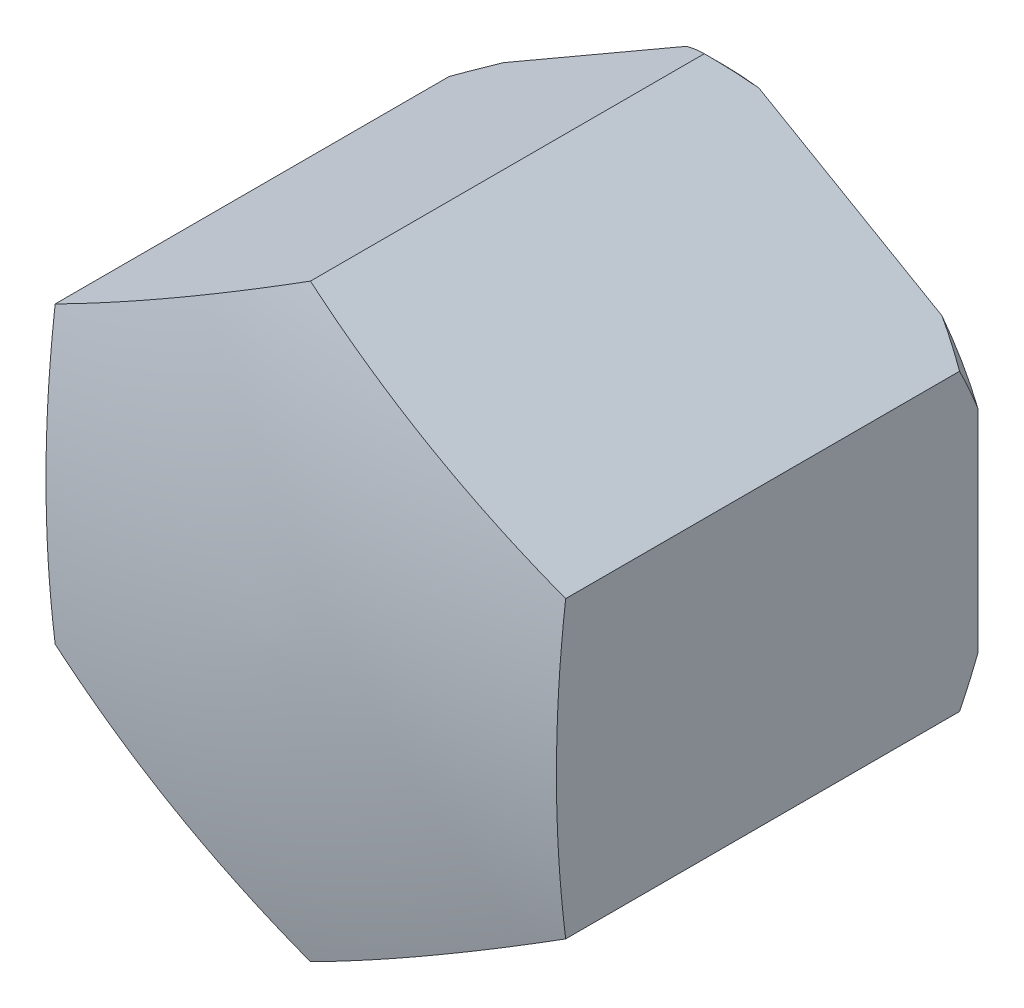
ISO-10303-21;
HEADER;
FILE_DESCRIPTION(('STEP AP214'),'2;1');
FILE_NAME('part.step','',(''),(''),'','','');
FILE_SCHEMA(('AUTOMOTIVE_DESIGN { 1 0 10303 214 1 1 1 1 }'));
ENDSEC;
DATA;
#1=APPLICATION_CONTEXT('core data for automotive mechanical design processes');
#2=APPLICATION_PROTOCOL_DEFINITION('international standard','automotive_design',2000,#1);
#3=PRODUCT_CONTEXT('',#1,'mechanical');
#4=PRODUCT('Part','Part','',(#3));
#5=PRODUCT_RELATED_PRODUCT_CATEGORY('part','',(#4));
#6=PRODUCT_DEFINITION_FORMATION('','',#4);
#7=PRODUCT_DEFINITION_CONTEXT('part definition',#1,'design');
#8=PRODUCT_DEFINITION('design','',#6,#7);
#9=PRODUCT_DEFINITION_SHAPE('','',#8);
#10=(LENGTH_UNIT() NAMED_UNIT(*) SI_UNIT(.MILLI.,.METRE.));
#11=(NAMED_UNIT(*) PLANE_ANGLE_UNIT() SI_UNIT($,.RADIAN.));
#12=(NAMED_UNIT(*) SI_UNIT($,.STERADIAN.) SOLID_ANGLE_UNIT());
#13=UNCERTAINTY_MEASURE_WITH_UNIT(LENGTH_MEASURE(1.E-05),#10,'distance_accuracy_value','');
#14=(GEOMETRIC_REPRESENTATION_CONTEXT(3) GLOBAL_UNCERTAINTY_ASSIGNED_CONTEXT((#13)) GLOBAL_UNIT_ASSIGNED_CONTEXT((#10,
#11,#12)) REPRESENTATION_CONTEXT('',''));
#15=CARTESIAN_POINT('',(0.,0.,0.));
#16=DIRECTION('',(0.,0.,1.));
#17=DIRECTION('',(1.,0.,0.));
#18=AXIS2_PLACEMENT_3D('',#15,#16,#17);
#19=CARTESIAN_POINT('',(0.,0.,0.));
#20=DIRECTION('',(0.,0.,1.));
#21=DIRECTION('',(0.,-1.,0.));
#22=AXIS2_PLACEMENT_3D('',#19,#20,#21);
#23=CONICAL_SURFACE('',#22,9.2,0.785398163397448);
#24=CARTESIAN_POINT('',(-7.29790748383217,5.60150572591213,-0.000200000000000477));
#25=CARTESIAN_POINT('',(-7.40034153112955,5.5423654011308,0.0450508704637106));
#26=CARTESIAN_POINT('',(-7.50220788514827,5.48355283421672,0.0919939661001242));
#27=CARTESIAN_POINT('',(-7.70476505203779,5.36660639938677,0.188958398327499));
#28=CARTESIAN_POINT('',(-7.80545653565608,5.30847214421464,0.238977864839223));
#29=CARTESIAN_POINT('',(-8.00574073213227,5.19283800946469,0.341840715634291));
#30=CARTESIAN_POINT('',(-8.1053335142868,5.13533808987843,0.394683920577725));
#31=CARTESIAN_POINT('',(-8.30352176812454,5.02091404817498,0.502984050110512));
#32=CARTESIAN_POINT('',(-8.40211660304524,4.96399029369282,0.558442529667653));
#33=CARTESIAN_POINT('',(-8.5002,4.90736181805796,0.615070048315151));
#34=B_SPLINE_CURVE_WITH_KNOTS('',3,(#24,#25,#26,#27,#28,#29,#30,#31,#32,#33),.UNSPECIFIED.,.F.,
.F.,(4,2,2,2,4),(0.,0.379899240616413,0.759569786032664,1.13921624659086,1.51909135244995),.UNSPECIFIED.);
#35=CARTESIAN_POINT('',(-7.29836021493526,5.60124434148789,0.));
#36=VERTEX_POINT('',#35);
#37=CARTESIAN_POINT('',(-8.5,4.9074772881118,0.614954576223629));
#38=VERTEX_POINT('',#37);
#39=EDGE_CURVE('E130',#36,#38,#34,.T.);
#40=ORIENTED_EDGE('',*,*,#39,.F.);
#41=CARTESIAN_POINT('',(0.,0.,0.));
#42=DIRECTION('',(0.,0.,-1.));
#43=DIRECTION('',(0.,1.,0.));
#44=AXIS2_PLACEMENT_3D('',#41,#42,#43);
#45=CIRCLE('',#44,9.2);
#46=CARTESIAN_POINT('',(-8.5,3.51994318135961,0.));
#47=VERTEX_POINT('',#46);
#48=EDGE_CURVE('E126',#47,#36,#45,.T.);
#49=ORIENTED_EDGE('',*,*,#48,.F.);
#50=CARTESIAN_POINT('',(-8.5,12.4457835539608,5.8714142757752));
#51=CARTESIAN_POINT('',(-8.5,12.2891803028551,5.74209565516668));
#52=CARTESIAN_POINT('',(-8.5,12.1321984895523,5.61323567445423));
#53=CARTESIAN_POINT('',(-8.5,11.8174015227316,5.35653348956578));
#54=CARTESIAN_POINT('',(-8.5,11.6595863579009,5.22869129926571));
#55=CARTESIAN_POINT('',(-8.5,11.1847073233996,4.84678663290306));
#56=CARTESIAN_POINT('',(-8.5,10.8662846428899,4.59440792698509));
#57=CARTESIAN_POINT('',(-8.5,10.2215636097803,4.09244014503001));
#58=CARTESIAN_POINT('',(-8.5,9.89521710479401,3.84291277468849));
#59=CARTESIAN_POINT('',(-8.5,9.23720301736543,3.35102204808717));
#60=CARTESIAN_POINT('',(-8.5,8.90553596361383,3.10865798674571));
#61=CARTESIAN_POINT('',(-8.5,8.20300679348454,2.60983458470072));
#62=CARTESIAN_POINT('',(-8.5,7.83147860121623,2.35430822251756));
#63=CARTESIAN_POINT('',(-8.5,7.07854417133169,1.85782964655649));
#64=CARTESIAN_POINT('',(-8.5,6.69713462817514,1.61688240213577));
#65=CARTESIAN_POINT('',(-8.5,5.9240959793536,1.15610654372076));
#66=CARTESIAN_POINT('',(-8.5,5.53252322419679,0.936184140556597));
#67=CARTESIAN_POINT('',(-8.5,4.73517422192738,0.523967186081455));
#68=CARTESIAN_POINT('',(-8.5,4.32941107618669,0.331647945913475));
#69=CARTESIAN_POINT('',(-8.5,3.77043546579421,0.0977888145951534));
#70=CARTESIAN_POINT('',(-8.5,3.62423019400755,0.0393998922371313));
#71=CARTESIAN_POINT('',(-8.5,3.32981396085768,-0.0720721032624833));
#72=CARTESIAN_POINT('',(-8.5,3.18160301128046,-0.125155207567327));
#73=CARTESIAN_POINT('',(-8.5,2.73391822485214,-0.275575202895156));
#74=CARTESIAN_POINT('',(-8.5,2.43138559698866,-0.364085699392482));
#75=CARTESIAN_POINT('',(-8.5,1.82627230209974,-0.510857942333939));
#76=CARTESIAN_POINT('',(-8.5,1.52384972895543,-0.569762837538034));
#77=CARTESIAN_POINT('',(-8.5,0.914521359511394,-0.656255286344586));
#78=CARTESIAN_POINT('',(-8.5,0.607616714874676,-0.683850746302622));
#79=CARTESIAN_POINT('',(-8.5,0.00960417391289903,-0.704956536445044));
#80=CARTESIAN_POINT('',(-8.5,-0.28144036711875,-0.700264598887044));
#81=CARTESIAN_POINT('',(-8.5,-0.861531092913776,-0.661355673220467));
#82=CARTESIAN_POINT('',(-8.5,-1.1505771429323,-0.627136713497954));
#83=CARTESIAN_POINT('',(-8.5,-1.72963784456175,-0.530601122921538));
#84=CARTESIAN_POINT('',(-8.5,-2.01956183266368,-0.467750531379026));
#85=CARTESIAN_POINT('',(-8.5,-2.59290217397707,-0.317629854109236));
#86=CARTESIAN_POINT('',(-8.5,-2.87631858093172,-0.230359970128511));
#87=CARTESIAN_POINT('',(-8.5,-3.44063093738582,-0.0339340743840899));
#88=CARTESIAN_POINT('',(-8.5,-3.72140761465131,0.075560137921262));
#89=CARTESIAN_POINT('',(-8.5,-4.2757903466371,0.31154116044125));
#90=CARTESIAN_POINT('',(-8.5,-4.54939321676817,0.438035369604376));
#91=CARTESIAN_POINT('',(-8.5,-5.09067942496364,0.705019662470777));
#92=CARTESIAN_POINT('',(-8.5,-5.35834183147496,0.845551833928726));
#93=CARTESIAN_POINT('',(-8.5,-5.88755334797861,1.13753327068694));
#94=CARTESIAN_POINT('',(-8.5,-6.14910336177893,1.2889809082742));
#95=CARTESIAN_POINT('',(-8.5,-6.65407957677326,1.59296889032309));
#96=CARTESIAN_POINT('',(-8.5,-6.89776250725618,1.74508502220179));
#97=CARTESIAN_POINT('',(-8.5,-7.38094108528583,2.05584685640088));
#98=CARTESIAN_POINT('',(-8.5,-7.62043642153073,2.21449304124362));
#99=CARTESIAN_POINT('',(-8.5,-8.09388147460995,2.5358803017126));
#100=CARTESIAN_POINT('',(-8.5,-8.32786010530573,2.69857893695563));
#101=CARTESIAN_POINT('',(-8.5,-8.7925997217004,3.02837993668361));
#102=CARTESIAN_POINT('',(-8.5,-9.02336157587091,3.19548107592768));
#103=CARTESIAN_POINT('',(-8.5,-9.25277218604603,3.36438590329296));
#104=B_SPLINE_CURVE_WITH_KNOTS('',3,(#50,#51,#52,#53,#54,#55,#56,#57,#58,#59,#60,#61,#62,#63,
#64,#65,#66,#67,#68,#69,#70,#71,#72,#73,#74,#75,#76,#77,#78,#79,#80,#81,#82,#83,#84,#85,#86,#87,
#88,#89,#90,#91,#92,#93,#94,#95,#96,#97,#98,#99,#100,#101,#102,#103),.UNSPECIFIED.,.F.,.F.,(4,2,
2,2,2,2,2,2,2,2,2,2,2,2,2,2,2,2,2,2,2,2,2,2,2,2,4),(0.,0.60928566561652,1.21857962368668,
2.43745855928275,3.66981545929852,4.90205065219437,6.25455110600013,7.60750999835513,
8.95412045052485,10.2995188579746,10.7717304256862,11.2439392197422,12.1883345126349,
13.1112160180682,14.0338644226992,14.9055731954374,15.7773401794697,16.6660762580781,
17.5548049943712,18.4582369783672,19.3620634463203,20.2686860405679,21.1751737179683,
22.0368444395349,22.8985789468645,23.7534810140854,24.6081476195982),.UNSPECIFIED.);
#105=EDGE_CURVE('E155',#38,#47,#104,.T.);
#106=ORIENTED_EDGE('',*,*,#105,.F.);
#107=EDGE_LOOP('',(#40,#49,#106));
#108=FACE_BOUND('',#107,.T.);
#109=ADVANCED_FACE('F14',(#108),#23,.T.);
#110=CARTESIAN_POINT('',(-8.5,-3.51994318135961,0.));
#111=VERTEX_POINT('',#110);
#112=CARTESIAN_POINT('',(-8.5,-4.9074772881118,0.614954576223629));
#113=VERTEX_POINT('',#112);
#114=EDGE_CURVE('E151',#111,#113,#104,.T.);
#115=ORIENTED_EDGE('',*,*,#114,.F.);
#116=CARTESIAN_POINT('',(-7.29836021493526,-5.60124434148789,0.));
#117=VERTEX_POINT('',#116);
#118=EDGE_CURVE('E129',#117,#111,#45,.T.);
#119=ORIENTED_EDGE('',*,*,#118,.F.);
#120=CARTESIAN_POINT('',(-8.5002,-4.90736181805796,0.615070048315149));
#121=CARTESIAN_POINT('',(-8.40211660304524,-4.96399029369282,0.558442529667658));
#122=CARTESIAN_POINT('',(-8.30352176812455,-5.02091404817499,0.502984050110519));
#123=CARTESIAN_POINT('',(-8.1053335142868,-5.13533808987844,0.394683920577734));
#124=CARTESIAN_POINT('',(-8.00574073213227,-5.1928380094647,0.341840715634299));
#125=CARTESIAN_POINT('',(-7.80545653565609,-5.30847214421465,0.238977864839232));
#126=CARTESIAN_POINT('',(-7.70476505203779,-5.36660639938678,0.188958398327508));
#127=CARTESIAN_POINT('',(-7.50220788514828,-5.48355283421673,0.0919939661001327));
#128=CARTESIAN_POINT('',(-7.40034153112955,-5.54236540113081,0.0450508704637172));
#129=CARTESIAN_POINT('',(-7.29790748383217,-5.60150572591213,-0.00019999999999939));
#130=B_SPLINE_CURVE_WITH_KNOTS('',3,(#120,#121,#122,#123,#124,#125,#126,#127,#128,#129),
.UNSPECIFIED.,.F.,.F.,(4,2,2,2,4),(0.,0.379875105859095,0.759521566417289,1.13919211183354,
1.51909135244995),.UNSPECIFIED.);
#131=EDGE_CURVE('E150',#113,#117,#130,.T.);
#132=ORIENTED_EDGE('',*,*,#131,.F.);
#133=EDGE_LOOP('',(#115,#119,#132));
#134=FACE_BOUND('',#133,.T.);
#135=ADVANCED_FACE('F149',(#134),#23,.T.);
#136=CARTESIAN_POINT('',(-1.20209251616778,-9.1209261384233,-0.000200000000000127));
#137=CARTESIAN_POINT('',(-1.09965846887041,-9.18006646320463,0.0450508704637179));
#138=CARTESIAN_POINT('',(-0.997792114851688,-9.2388790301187,0.0919939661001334));
#139=CARTESIAN_POINT('',(-0.795234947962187,-9.35582546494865,0.188958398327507));
#140=CARTESIAN_POINT('',(-0.694543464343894,-9.41395972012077,0.238977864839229));
#141=CARTESIAN_POINT('',(-0.494259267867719,-9.52959385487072,0.341840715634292));
#142=CARTESIAN_POINT('',(-0.39466648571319,-9.58709377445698,0.394683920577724));
#143=CARTESIAN_POINT('',(-0.196478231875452,-9.70151781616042,0.502984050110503));
#144=CARTESIAN_POINT('',(-0.0978833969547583,-9.75844157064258,0.558442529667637));
#145=CARTESIAN_POINT('',(0.000199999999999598,-9.81507004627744,0.615070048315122));
#146=B_SPLINE_CURVE_WITH_KNOTS('',3,(#136,#137,#138,#139,#140,#141,#142,#143,#144,#145),
.UNSPECIFIED.,.F.,.F.,(4,2,2,2,4),(0.,0.379899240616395,0.759569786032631,1.13921624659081,
1.51909135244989),.UNSPECIFIED.);
#147=CARTESIAN_POINT('',(-1.20163978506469,-9.12118752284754,0.));
#148=VERTEX_POINT('',#147);
#149=CARTESIAN_POINT('',(0.,-9.8149545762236,0.614954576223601));
#150=VERTEX_POINT('',#149);
#151=EDGE_CURVE('E159',#148,#150,#146,.T.);
#152=ORIENTED_EDGE('',*,*,#151,.F.);
#153=CARTESIAN_POINT('',(1.20163978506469,-9.12118752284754,0.));
#154=VERTEX_POINT('',#153);
#155=EDGE_CURVE('E135',#154,#148,#45,.T.);
#156=ORIENTED_EDGE('',*,*,#155,.F.);
#157=CARTESIAN_POINT('',(-0.000200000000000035,-9.81507004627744,0.615070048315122));
#158=CARTESIAN_POINT('',(0.097883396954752,-9.75844157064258,0.55844252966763));
#159=CARTESIAN_POINT('',(0.196478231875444,-9.70151781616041,0.502984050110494));
#160=CARTESIAN_POINT('',(0.394666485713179,-9.58709377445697,0.394683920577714));
#161=CARTESIAN_POINT('',(0.494259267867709,-9.52959385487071,0.341840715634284));
#162=CARTESIAN_POINT('',(0.694543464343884,-9.41395972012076,0.238977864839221));
#163=CARTESIAN_POINT('',(0.795234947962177,-9.35582546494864,0.188958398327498));
#164=CARTESIAN_POINT('',(0.99779211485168,-9.2388790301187,0.0919939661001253));
#165=CARTESIAN_POINT('',(1.0996584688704,-9.18006646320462,0.0450508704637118));
#166=CARTESIAN_POINT('',(1.20209251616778,-9.1209261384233,-0.000200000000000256));
#167=B_SPLINE_CURVE_WITH_KNOTS('',3,(#157,#158,#159,#160,#161,#162,#163,#164,#165,#166),
.UNSPECIFIED.,.F.,.F.,(4,2,2,2,4),(0.,0.37987510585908,0.759521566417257,1.13919211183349,
1.51909135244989),.UNSPECIFIED.);
#168=EDGE_CURVE('E306',#150,#154,#167,.T.);
#169=ORIENTED_EDGE('',*,*,#168,.F.);
#170=EDGE_LOOP('',(#152,#156,#169));
#171=FACE_BOUND('',#170,.T.);
#172=ADVANCED_FACE('F291',(#171),#23,.T.);
#173=CARTESIAN_POINT('',(7.29790748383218,-5.60150572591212,-0.000199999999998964));
#174=CARTESIAN_POINT('',(7.40034153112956,-5.54236540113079,0.0450508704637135));
#175=CARTESIAN_POINT('',(7.50220788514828,-5.48355283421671,0.091993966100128));
#176=CARTESIAN_POINT('',(7.70476505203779,-5.36660639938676,0.188958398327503));
#177=CARTESIAN_POINT('',(7.80545653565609,-5.30847214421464,0.238977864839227));
#178=CARTESIAN_POINT('',(8.00574073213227,-5.19283800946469,0.341840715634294));
#179=CARTESIAN_POINT('',(8.10533351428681,-5.13533808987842,0.394683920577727));
#180=CARTESIAN_POINT('',(8.30352176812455,-5.02091404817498,0.502984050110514));
#181=CARTESIAN_POINT('',(8.40211660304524,-4.96399029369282,0.558442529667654));
#182=CARTESIAN_POINT('',(8.5002,-4.90736181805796,0.615070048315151));
#183=B_SPLINE_CURVE_WITH_KNOTS('',3,(#173,#174,#175,#176,#177,#178,#179,#180,#181,#182),
.UNSPECIFIED.,.F.,.F.,(4,2,2,2,4),(0.,0.37989924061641,0.759569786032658,1.13921624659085,
1.51909135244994),.UNSPECIFIED.);
#184=CARTESIAN_POINT('',(7.29836021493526,-5.60124434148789,0.));
#185=VERTEX_POINT('',#184);
#186=CARTESIAN_POINT('',(8.5,-4.9074772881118,0.614954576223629));
#187=VERTEX_POINT('',#186);
#188=EDGE_CURVE('E302',#185,#187,#183,.T.);
#189=ORIENTED_EDGE('',*,*,#188,.F.);
#190=CARTESIAN_POINT('',(8.5,-3.51994318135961,0.));
#191=VERTEX_POINT('',#190);
#192=EDGE_CURVE('E132',#191,#185,#45,.T.);
#193=ORIENTED_EDGE('',*,*,#192,.F.);
#194=CARTESIAN_POINT('',(8.5,12.4457835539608,5.8714142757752));
#195=CARTESIAN_POINT('',(8.5,12.2891803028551,5.74209565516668));
#196=CARTESIAN_POINT('',(8.5,12.1321984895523,5.61323567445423));
#197=CARTESIAN_POINT('',(8.5,11.8174015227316,5.35653348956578));
#198=CARTESIAN_POINT('',(8.5,11.6595863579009,5.22869129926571));
#199=CARTESIAN_POINT('',(8.5,11.1847073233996,4.84678663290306));
#200=CARTESIAN_POINT('',(8.5,10.8662846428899,4.59440792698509));
#201=CARTESIAN_POINT('',(8.5,10.2215636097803,4.09244014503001));
#202=CARTESIAN_POINT('',(8.5,9.89521710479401,3.84291277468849));
#203=CARTESIAN_POINT('',(8.5,9.23720301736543,3.35102204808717));
#204=CARTESIAN_POINT('',(8.5,8.90553596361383,3.10865798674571));
#205=CARTESIAN_POINT('',(8.5,8.20300679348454,2.60983458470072));
#206=CARTESIAN_POINT('',(8.5,7.83147860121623,2.35430822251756));
#207=CARTESIAN_POINT('',(8.5,7.07854417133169,1.85782964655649));
#208=CARTESIAN_POINT('',(8.5,6.69713462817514,1.61688240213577));
#209=CARTESIAN_POINT('',(8.5,5.9240959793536,1.15610654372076));
#210=CARTESIAN_POINT('',(8.5,5.53252322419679,0.936184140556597));
#211=CARTESIAN_POINT('',(8.5,4.73517422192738,0.523967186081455));
#212=CARTESIAN_POINT('',(8.5,4.32941107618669,0.331647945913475));
#213=CARTESIAN_POINT('',(8.5,3.77043546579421,0.0977888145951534));
#214=CARTESIAN_POINT('',(8.5,3.62423019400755,0.0393998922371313));
#215=CARTESIAN_POINT('',(8.5,3.32981396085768,-0.0720721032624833));
#216=CARTESIAN_POINT('',(8.5,3.18160301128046,-0.125155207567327));
#217=CARTESIAN_POINT('',(8.5,2.73391822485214,-0.275575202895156));
#218=CARTESIAN_POINT('',(8.5,2.43138559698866,-0.364085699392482));
#219=CARTESIAN_POINT('',(8.5,1.82627230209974,-0.510857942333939));
#220=CARTESIAN_POINT('',(8.5,1.52384972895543,-0.569762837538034));
#221=CARTESIAN_POINT('',(8.5,0.914521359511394,-0.656255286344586));
#222=CARTESIAN_POINT('',(8.5,0.607616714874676,-0.683850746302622));
#223=CARTESIAN_POINT('',(8.5,0.00960417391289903,-0.704956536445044));
#224=CARTESIAN_POINT('',(8.5,-0.28144036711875,-0.700264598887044));
#225=CARTESIAN_POINT('',(8.5,-0.861531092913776,-0.661355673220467));
#226=CARTESIAN_POINT('',(8.5,-1.1505771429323,-0.627136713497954));
#227=CARTESIAN_POINT('',(8.5,-1.72963784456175,-0.530601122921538));
#228=CARTESIAN_POINT('',(8.5,-2.01956183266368,-0.467750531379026));
#229=CARTESIAN_POINT('',(8.5,-2.59290217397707,-0.317629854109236));
#230=CARTESIAN_POINT('',(8.5,-2.87631858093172,-0.230359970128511));
#231=CARTESIAN_POINT('',(8.5,-3.44063093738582,-0.0339340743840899));
#232=CARTESIAN_POINT('',(8.5,-3.72140761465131,0.075560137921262));
#233=CARTESIAN_POINT('',(8.5,-4.2757903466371,0.31154116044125));
#234=CARTESIAN_POINT('',(8.5,-4.54939321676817,0.438035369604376));
#235=CARTESIAN_POINT('',(8.5,-5.09067942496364,0.705019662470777));
#236=CARTESIAN_POINT('',(8.5,-5.35834183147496,0.845551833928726));
#237=CARTESIAN_POINT('',(8.5,-5.88755334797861,1.13753327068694));
#238=CARTESIAN_POINT('',(8.5,-6.14910336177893,1.2889809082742));
#239=CARTESIAN_POINT('',(8.5,-6.65407957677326,1.59296889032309));
#240=CARTESIAN_POINT('',(8.5,-6.89776250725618,1.74508502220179));
#241=CARTESIAN_POINT('',(8.5,-7.38094108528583,2.05584685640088));
#242=CARTESIAN_POINT('',(8.5,-7.62043642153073,2.21449304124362));
#243=CARTESIAN_POINT('',(8.5,-8.09388147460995,2.5358803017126));
#244=CARTESIAN_POINT('',(8.5,-8.32786010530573,2.69857893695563));
#245=CARTESIAN_POINT('',(8.5,-8.7925997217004,3.02837993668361));
#246=CARTESIAN_POINT('',(8.5,-9.02336157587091,3.19548107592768));
#247=CARTESIAN_POINT('',(8.5,-9.25277218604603,3.36438590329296));
#248=B_SPLINE_CURVE_WITH_KNOTS('',3,(#194,#195,#196,#197,#198,#199,#200,#201,#202,#203,#204,
#205,#206,#207,#208,#209,#210,#211,#212,#213,#214,#215,#216,#217,#218,#219,#220,#221,#222,#223,
#224,#225,#226,#227,#228,#229,#230,#231,#232,#233,#234,#235,#236,#237,#238,#239,#240,#241,#242,
#243,#244,#245,#246,#247),.UNSPECIFIED.,.F.,.F.,(4,2,2,2,2,2,2,2,2,2,2,2,2,2,2,2,2,2,2,2,2,2,2,
2,2,2,4),(0.,0.60928566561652,1.21857962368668,2.43745855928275,3.66981545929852,
4.90205065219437,6.25455110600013,7.60750999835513,8.95412045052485,10.2995188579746,
10.7717304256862,11.2439392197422,12.1883345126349,13.1112160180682,14.0338644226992,
14.9055731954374,15.7773401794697,16.6660762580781,17.5548049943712,18.4582369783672,
19.3620634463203,20.2686860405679,21.1751737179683,22.0368444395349,22.8985789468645,
23.7534810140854,24.6081476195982),.UNSPECIFIED.);
#249=EDGE_CURVE('E226',#187,#191,#248,.F.);
#250=ORIENTED_EDGE('',*,*,#249,.F.);
#251=EDGE_LOOP('',(#189,#193,#250));
#252=FACE_BOUND('',#251,.T.);
#253=ADVANCED_FACE('F301',(#252),#23,.T.);
#254=CARTESIAN_POINT('',(0.000200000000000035,9.81507004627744,0.615070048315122));
#255=CARTESIAN_POINT('',(-0.097883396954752,9.75844157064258,0.55844252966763));
#256=CARTESIAN_POINT('',(-0.196478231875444,9.70151781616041,0.502984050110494));
#257=CARTESIAN_POINT('',(-0.394666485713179,9.58709377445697,0.394683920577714));
#258=CARTESIAN_POINT('',(-0.494259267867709,9.52959385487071,0.341840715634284));
#259=CARTESIAN_POINT('',(-0.694543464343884,9.41395972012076,0.238977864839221));
#260=CARTESIAN_POINT('',(-0.795234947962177,9.35582546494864,0.188958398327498));
#261=CARTESIAN_POINT('',(-0.99779211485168,9.2388790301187,0.0919939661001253));
#262=CARTESIAN_POINT('',(-1.0996584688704,9.18006646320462,0.0450508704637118));
#263=CARTESIAN_POINT('',(-1.20209251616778,9.1209261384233,-0.000200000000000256));
#264=B_SPLINE_CURVE_WITH_KNOTS('',3,(#254,#255,#256,#257,#258,#259,#260,#261,#262,#263),
.UNSPECIFIED.,.F.,.F.,(4,2,2,2,4),(0.,0.37987510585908,0.759521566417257,1.13919211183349,
1.51909135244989),.UNSPECIFIED.);
#265=CARTESIAN_POINT('',(0.,9.8149545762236,0.614954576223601));
#266=VERTEX_POINT('',#265);
#267=CARTESIAN_POINT('',(-1.20163978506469,9.12118752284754,0.));
#268=VERTEX_POINT('',#267);
#269=EDGE_CURVE('E119',#266,#268,#264,.T.);
#270=ORIENTED_EDGE('',*,*,#269,.F.);
#271=CARTESIAN_POINT('',(1.20209251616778,9.1209261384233,-0.000200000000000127));
#272=CARTESIAN_POINT('',(1.09965846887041,9.18006646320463,0.0450508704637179));
#273=CARTESIAN_POINT('',(0.997792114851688,9.2388790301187,0.0919939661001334));
#274=CARTESIAN_POINT('',(0.795234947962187,9.35582546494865,0.188958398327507));
#275=CARTESIAN_POINT('',(0.694543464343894,9.41395972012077,0.238977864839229));
#276=CARTESIAN_POINT('',(0.494259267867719,9.52959385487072,0.341840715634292));
#277=CARTESIAN_POINT('',(0.39466648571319,9.58709377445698,0.394683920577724));
#278=CARTESIAN_POINT('',(0.196478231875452,9.70151781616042,0.502984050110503));
#279=CARTESIAN_POINT('',(0.0978833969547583,9.75844157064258,0.558442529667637));
#280=CARTESIAN_POINT('',(-0.000199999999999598,9.81507004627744,0.615070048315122));
#281=B_SPLINE_CURVE_WITH_KNOTS('',3,(#271,#272,#273,#274,#275,#276,#277,#278,#279,#280),
.UNSPECIFIED.,.F.,.F.,(4,2,2,2,4),(0.,0.379899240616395,0.759569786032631,1.13921624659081,
1.51909135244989),.UNSPECIFIED.);
#282=CARTESIAN_POINT('',(1.20163978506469,9.12118752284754,0.));
#283=VERTEX_POINT('',#282);
#284=EDGE_CURVE('E106',#283,#266,#281,.T.);
#285=ORIENTED_EDGE('',*,*,#284,.F.);
#286=EDGE_CURVE('E118',#268,#283,#45,.T.);
#287=ORIENTED_EDGE('',*,*,#286,.F.);
#288=EDGE_LOOP('',(#270,#285,#287));
#289=FACE_BOUND('',#288,.T.);
#290=ADVANCED_FACE('F117',(#289),#23,.T.);
#291=CARTESIAN_POINT('',(8.5,3.51994318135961,0.));
#292=VERTEX_POINT('',#291);
#293=CARTESIAN_POINT('',(8.5,4.9074772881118,0.614954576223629));
#294=VERTEX_POINT('',#293);
#295=EDGE_CURVE('E224',#292,#294,#248,.F.);
#296=ORIENTED_EDGE('',*,*,#295,.F.);
#297=CARTESIAN_POINT('',(7.29836021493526,5.60124434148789,0.));
#298=VERTEX_POINT('',#297);
#299=EDGE_CURVE('E112',#298,#292,#45,.T.);
#300=ORIENTED_EDGE('',*,*,#299,.F.);
#301=CARTESIAN_POINT('',(8.5002,4.90736181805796,0.615070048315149));
#302=CARTESIAN_POINT('',(8.40211660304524,4.96399029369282,0.558442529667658));
#303=CARTESIAN_POINT('',(8.30352176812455,5.02091404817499,0.50298405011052));
#304=CARTESIAN_POINT('',(8.10533351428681,5.13533808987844,0.394683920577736));
#305=CARTESIAN_POINT('',(8.00574073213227,5.1928380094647,0.341840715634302));
#306=CARTESIAN_POINT('',(7.80545653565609,5.30847214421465,0.238977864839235));
#307=CARTESIAN_POINT('',(7.70476505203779,5.36660639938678,0.188958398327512));
#308=CARTESIAN_POINT('',(7.50220788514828,5.48355283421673,0.0919939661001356));
#309=CARTESIAN_POINT('',(7.40034153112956,5.5423654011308,0.0450508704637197));
#310=CARTESIAN_POINT('',(7.29790748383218,5.60150572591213,-0.000199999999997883));
#311=B_SPLINE_CURVE_WITH_KNOTS('',3,(#301,#302,#303,#304,#305,#306,#307,#308,#309,#310),
.UNSPECIFIED.,.F.,.F.,(4,2,2,2,4),(0.,0.379875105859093,0.759521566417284,1.13919211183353,
1.51909135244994),.UNSPECIFIED.);
#312=EDGE_CURVE('E37',#294,#298,#311,.T.);
#313=ORIENTED_EDGE('',*,*,#312,.F.);
#314=EDGE_LOOP('',(#296,#300,#313));
#315=FACE_BOUND('',#314,.T.);
#316=ADVANCED_FACE('F177',(#315),#23,.T.);
#317=CARTESIAN_POINT('',(9.2,0.,0.));
#318=DIRECTION('',(0.,0.,-1.));
#319=DIRECTION('',(0.,1.,0.));
#320=AXIS2_PLACEMENT_3D('',#317,#318,#319);
#321=PLANE('',#320);
#322=DIRECTION('',(-0.86602540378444,-0.5,0.));
#323=VECTOR('',#322,1.);
#324=CARTESIAN_POINT('',(2.65000000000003,11.3449327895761,0.));
#325=LINE('',#324,#323);
#326=EDGE_CURVE('E9',#268,#36,#325,.T.);
#327=ORIENTED_EDGE('',*,*,#326,.F.);
#328=ORIENTED_EDGE('',*,*,#286,.T.);
#329=DIRECTION('',(-0.86602540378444,0.5,0.));
#330=VECTOR('',#329,1.);
#331=CARTESIAN_POINT('',(11.15,3.37749907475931,0.));
#332=LINE('',#331,#330);
#333=EDGE_CURVE('E103',#298,#283,#332,.T.);
#334=ORIENTED_EDGE('',*,*,#333,.F.);
#335=ORIENTED_EDGE('',*,*,#299,.T.);
#336=DIRECTION('',(0.,1.,0.));
#337=VECTOR('',#336,1.);
#338=CARTESIAN_POINT('',(8.5,0.,0.));
#339=LINE('',#338,#337);
#340=EDGE_CURVE('E111',#191,#292,#339,.T.);
#341=ORIENTED_EDGE('',*,*,#340,.F.);
#342=ORIENTED_EDGE('',*,*,#192,.T.);
#343=DIRECTION('',(0.86602540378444,0.5,0.));
#344=VECTOR('',#343,1.);
#345=CARTESIAN_POINT('',(11.15,-3.37749907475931,0.));
#346=LINE('',#345,#344);
#347=EDGE_CURVE('E292',#154,#185,#346,.T.);
#348=ORIENTED_EDGE('',*,*,#347,.F.);
#349=ORIENTED_EDGE('',*,*,#155,.T.);
#350=DIRECTION('',(0.86602540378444,-0.5,0.));
#351=VECTOR('',#350,1.);
#352=CARTESIAN_POINT('',(2.65000000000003,-11.3449327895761,0.));
#353=LINE('',#352,#351);
#354=EDGE_CURVE('E145',#117,#148,#353,.T.);
#355=ORIENTED_EDGE('',*,*,#354,.F.);
#356=ORIENTED_EDGE('',*,*,#118,.T.);
#357=DIRECTION('',(0.,-1.,0.));
#358=VECTOR('',#357,1.);
#359=CARTESIAN_POINT('',(-8.5,0.,0.));
#360=LINE('',#359,#358);
#361=EDGE_CURVE('E23',#47,#111,#360,.T.);
#362=ORIENTED_EDGE('',*,*,#361,.F.);
#363=ORIENTED_EDGE('',*,*,#48,.T.);
#364=EDGE_LOOP('',(#327,#328,#334,#335,#341,#342,#348,#349,#355,#356,#362,#363));
#365=FACE_BOUND('',#364,.T.);
#366=CARTESIAN_POINT('',(0.,0.,0.));
#367=DIRECTION('',(0.,0.,-1.));
#368=DIRECTION('',(-1.,0.,0.));
#369=AXIS2_PLACEMENT_3D('',#366,#367,#368);
#370=CIRCLE('',#369,4.);
#371=CARTESIAN_POINT('',(-4.,0.,0.));
#372=VERTEX_POINT('',#371);
#373=EDGE_CURVE('E269',#372,#372,#370,.T.);
#374=ORIENTED_EDGE('',*,*,#373,.F.);
#375=EDGE_LOOP('',(#374));
#376=FACE_BOUND('',#375,.T.);
#377=ADVANCED_FACE('F123',(#365,#376),#321,.T.);
#378=CARTESIAN_POINT('',(0.,9.8149545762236,16.));
#379=DIRECTION('',(0.5,-0.86602540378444,0.));
#380=DIRECTION('',(0.86602540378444,0.5,0.));
#381=AXIS2_PLACEMENT_3D('',#378,#379,#380);
#382=PLANE('',#381);
#383=CARTESIAN_POINT('',(-8.5002,4.90736181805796,13.731601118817));
#384=CARTESIAN_POINT('',(-7.08346666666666,5.72531318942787,13.9362543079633));
#385=CARTESIAN_POINT('',(-5.66673333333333,6.54326456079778,14.0385809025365));
#386=CARTESIAN_POINT('',(-2.83326666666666,8.17916730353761,14.0385809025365));
#387=CARTESIAN_POINT('',(-1.41653333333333,8.99711867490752,13.9362543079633));
#388=CARTESIAN_POINT('',(0.000200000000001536,9.81507004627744,13.731601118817));
#389=B_SPLINE_CURVE_WITH_KNOTS('',3,(#383,#384,#385,#386,#387,#388),.UNSPECIFIED.,.F.,.F.,(4,2,
4),(0.,4.91729973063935,9.83459946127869),.UNSPECIFIED.);
#390=CARTESIAN_POINT('',(-8.5,4.9074772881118,13.7316300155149));
#391=VERTEX_POINT('',#390);
#392=CARTESIAN_POINT('',(-1.88602539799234E-11,9.81495457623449,13.7316300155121));
#393=VERTEX_POINT('',#392);
#394=EDGE_CURVE('E127',#391,#393,#389,.T.);
#395=ORIENTED_EDGE('',*,*,#394,.T.);
#396=DIRECTION('',(0.,0.,-1.));
#397=VECTOR('',#396,1.);
#398=CARTESIAN_POINT('',(0.,9.8149545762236,16.));
#399=LINE('',#398,#397);
#400=EDGE_CURVE('E30',#393,#266,#399,.T.);
#401=ORIENTED_EDGE('',*,*,#400,.T.);
#402=ORIENTED_EDGE('',*,*,#269,.T.);
#403=ORIENTED_EDGE('',*,*,#326,.T.);
#404=ORIENTED_EDGE('',*,*,#39,.T.);
#405=DIRECTION('',(0.,0.,-1.));
#406=VECTOR('',#405,1.);
#407=CARTESIAN_POINT('',(-8.5,4.9074772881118,16.));
#408=LINE('',#407,#406);
#409=EDGE_CURVE('E211',#391,#38,#408,.T.);
#410=ORIENTED_EDGE('',*,*,#409,.F.);
#411=EDGE_LOOP('',(#395,#401,#402,#403,#404,#410));
#412=FACE_BOUND('',#411,.T.);
#413=ADVANCED_FACE('F185',(#412),#382,.F.);
#414=CARTESIAN_POINT('',(-8.5,4.9074772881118,16.));
#415=DIRECTION('',(1.,0.,0.));
#416=DIRECTION('',(0.,1.,0.));
#417=AXIS2_PLACEMENT_3D('',#414,#415,#416);
#418=PLANE('',#417);
#419=CARTESIAN_POINT('',(-8.5,0.,14.038580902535));
#420=CARTESIAN_POINT('',(-8.5,0.722083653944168,14.0385785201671));
#421=CARTESIAN_POINT('',(-8.5,1.44419633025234,14.0186120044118));
#422=CARTESIAN_POINT('',(-8.5,2.88615779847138,13.9390309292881));
#423=CARTESIAN_POINT('',(-8.5,3.60600674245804,13.8794190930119));
#424=CARTESIAN_POINT('',(-8.5,5.04158879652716,13.7212005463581));
#425=CARTESIAN_POINT('',(-8.5,5.75732087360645,13.6225844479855));
#426=CARTESIAN_POINT('',(-8.5,7.18256974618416,13.3871145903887));
#427=CARTESIAN_POINT('',(-8.5,7.89208516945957,13.2502525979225));
#428=CARTESIAN_POINT('',(-8.5,9.7268210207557,12.8454891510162));
#429=CARTESIAN_POINT('',(-8.5,10.845705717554,12.5482597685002));
#430=CARTESIAN_POINT('',(-8.5,13.0546483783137,11.8606019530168));
#431=CARTESIAN_POINT('',(-8.5,14.1446982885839,11.4701477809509));
#432=CARTESIAN_POINT('',(-8.5,16.2893926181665,10.5987732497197));
#433=CARTESIAN_POINT('',(-8.5,17.3439983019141,10.1177574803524));
#434=CARTESIAN_POINT('',(-8.5,19.4091554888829,9.06918064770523));
#435=CARTESIAN_POINT('',(-8.5,20.419710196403,8.50162589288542));
#436=CARTESIAN_POINT('',(-8.5,22.3918360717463,7.28280845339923));
#437=CARTESIAN_POINT('',(-8.5,23.3533042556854,6.63137912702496));
#438=CARTESIAN_POINT('',(-8.5,25.2183711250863,5.25033905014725));
#439=CARTESIAN_POINT('',(-8.5,26.1219687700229,4.52072689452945));
#440=CARTESIAN_POINT('',(-8.5,27.8647328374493,2.98869896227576));
#441=CARTESIAN_POINT('',(-8.5,28.7039171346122,2.18630351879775));
#442=CARTESIAN_POINT('',(-8.5,30.3122803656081,0.514180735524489));
#443=CARTESIAN_POINT('',(-8.5,31.0814592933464,-0.355546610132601));
#444=CARTESIAN_POINT('',(-8.5,32.5497947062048,-2.16281533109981));
#445=CARTESIAN_POINT('',(-8.5,33.2483989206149,-3.10080548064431));
#446=CARTESIAN_POINT('',(-8.5,34.5641917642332,-5.0322554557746));
#447=CARTESIAN_POINT('',(-8.5,35.181379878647,-6.02571563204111));
#448=CARTESIAN_POINT('',(-8.5,36.330012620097,-8.06112542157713));
#449=CARTESIAN_POINT('',(-8.5,36.8614507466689,-9.10307870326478));
#450=CARTESIAN_POINT('',(-8.5,37.8347635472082,-11.2280075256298));
#451=CARTESIAN_POINT('',(-8.5,38.2766382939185,-12.3109830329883));
#452=CARTESIAN_POINT('',(-8.5,39.0680961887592,-14.5113849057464));
#453=CARTESIAN_POINT('',(-8.5,39.4175857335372,-15.6288449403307));
#454=CARTESIAN_POINT('',(-8.5,40.0212069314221,-17.8892305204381));
#455=CARTESIAN_POINT('',(-8.5,40.2753384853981,-19.0321560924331));
#456=CARTESIAN_POINT('',(-8.5,40.6864373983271,-21.3353331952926));
#457=CARTESIAN_POINT('',(-8.5,40.8434061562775,-22.4955844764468));
#458=CARTESIAN_POINT('',(-8.5,41.0590715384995,-24.8251844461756));
#459=CARTESIAN_POINT('',(-8.5,41.1177681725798,-25.9945331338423));
#460=CARTESIAN_POINT('',(-8.5,41.1364751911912,-28.3343098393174));
#461=CARTESIAN_POINT('',(-8.5,41.0964611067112,-29.5047380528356));
#462=CARTESIAN_POINT('',(-8.5,40.9179794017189,-31.8380637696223));
#463=CARTESIAN_POINT('',(-8.5,40.7795117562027,-33.0009612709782));
#464=CARTESIAN_POINT('',(-8.5,40.4051023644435,-35.310979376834));
#465=CARTESIAN_POINT('',(-8.5,40.1691588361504,-36.4580996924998));
#466=CARTESIAN_POINT('',(-8.5,39.6014723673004,-38.7283856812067));
#467=CARTESIAN_POINT('',(-8.5,39.2697294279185,-39.8515513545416));
#468=CARTESIAN_POINT('',(-8.5,38.5127882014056,-42.0659726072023));
#469=CARTESIAN_POINT('',(-8.5,38.0875872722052,-43.1572272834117));
#470=CARTESIAN_POINT('',(-8.5,37.1467536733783,-45.3000313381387));
#471=CARTESIAN_POINT('',(-8.5,36.6311210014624,-46.3515807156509));
#472=CARTESIAN_POINT('',(-8.5,35.5131117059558,-48.4074406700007));
#473=CARTESIAN_POINT('',(-8.5,34.9107394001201,-49.4117535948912));
#474=CARTESIAN_POINT('',(-8.5,33.6235064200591,-51.3660473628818));
#475=CARTESIAN_POINT('',(-8.5,32.9386457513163,-52.316028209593));
#476=CARTESIAN_POINT('',(-8.5,31.4914678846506,-54.1546711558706));
#477=CARTESIAN_POINT('',(-8.5,30.7291691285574,-55.0433477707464));
#478=CARTESIAN_POINT('',(-8.5,29.1323860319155,-56.7532929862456));
#479=CARTESIAN_POINT('',(-8.5,28.297901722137,-57.5745616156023));
#480=CARTESIAN_POINT('',(-8.5,26.5625589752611,-59.1439168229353));
#481=CARTESIAN_POINT('',(-8.5,25.6616925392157,-59.8919945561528));
#482=CARTESIAN_POINT('',(-8.5,23.8000593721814,-61.3094884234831));
#483=CARTESIAN_POINT('',(-8.5,22.8392925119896,-61.9789043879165));
#484=CARTESIAN_POINT('',(-8.5,20.8654828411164,-63.2337149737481));
#485=CARTESIAN_POINT('',(-8.5,19.8524837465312,-63.8191783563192));
#486=CARTESIAN_POINT('',(-8.5,17.7806583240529,-64.9024438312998));
#487=CARTESIAN_POINT('',(-8.5,16.7218323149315,-65.4002465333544));
#488=CARTESIAN_POINT('',(-8.5,14.565895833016,-66.3043918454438));
#489=CARTESIAN_POINT('',(-8.5,13.4687881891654,-66.7107411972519));
#490=CARTESIAN_POINT('',(-8.5,11.2439891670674,-67.4287045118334));
#491=CARTESIAN_POINT('',(-8.5,10.116296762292,-67.7403152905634));
#492=CARTESIAN_POINT('',(-8.5,7.84372892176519,-68.2644376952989));
#493=CARTESIAN_POINT('',(-8.5,6.69896479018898,-68.4774275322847));
#494=CARTESIAN_POINT('',(-8.5,4.97152330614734,-68.7218738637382));
#495=CARTESIAN_POINT('',(-8.5,4.39393215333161,-68.7908528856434));
#496=CARTESIAN_POINT('',(-8.5,3.23629549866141,-68.903416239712));
#497=CARTESIAN_POINT('',(-8.5,2.65625025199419,-68.9470031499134));
#498=CARTESIAN_POINT('',(-8.5,1.49496319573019,-69.0084449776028));
#499=CARTESIAN_POINT('',(-8.5,0.913721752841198,-69.0263068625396));
#500=CARTESIAN_POINT('',(-8.5,-0.248981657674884,-69.0361603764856));
#501=CARTESIAN_POINT('',(-8.5,-0.830443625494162,-69.0281519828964));
#502=CARTESIAN_POINT('',(-8.5,-1.99242716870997,-68.9863385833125));
#503=CARTESIAN_POINT('',(-8.5,-2.57294877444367,-68.9525344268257));
#504=CARTESIAN_POINT('',(-8.5,-3.73195605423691,-68.8594137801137));
#505=CARTESIAN_POINT('',(-8.5,-4.31044153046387,-68.8000948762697));
#506=CARTESIAN_POINT('',(-8.5,-5.99647795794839,-68.5899921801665));
#507=CARTESIAN_POINT('',(-8.5,-7.09999013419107,-68.4053063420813));
#508=CARTESIAN_POINT('',(-8.5,-9.28789144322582,-67.9458487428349));
#509=CARTESIAN_POINT('',(-8.5,-10.3722808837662,-67.6710784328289));
#510=CARTESIAN_POINT('',(-8.5,-12.5155224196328,-67.0339951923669));
#511=CARTESIAN_POINT('',(-8.5,-13.5743643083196,-66.6716478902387));
#512=CARTESIAN_POINT('',(-8.5,-15.6591641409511,-65.8622997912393));
#513=CARTESIAN_POINT('',(-8.5,-16.6851218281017,-65.4152983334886));
#514=CARTESIAN_POINT('',(-8.5,-18.7273814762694,-64.4253242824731));
#515=CARTESIAN_POINT('',(-8.5,-19.742495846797,-63.8798997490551));
#516=CARTESIAN_POINT('',(-8.5,-21.7238833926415,-62.7065501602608));
#517=CARTESIAN_POINT('',(-8.5,-22.6901554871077,-62.0786232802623));
#518=CARTESIAN_POINT('',(-8.5,-24.5670670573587,-60.7447959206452));
#519=CARTESIAN_POINT('',(-8.5,-25.4777152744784,-60.0389077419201));
#520=CARTESIAN_POINT('',(-8.5,-27.2372896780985,-58.5539976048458));
#521=CARTESIAN_POINT('',(-8.5,-28.0862157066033,-57.7749754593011));
#522=CARTESIAN_POINT('',(-8.5,-29.7280463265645,-56.1376959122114));
#523=CARTESIAN_POINT('',(-8.5,-30.5199898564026,-55.2784744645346));
#524=CARTESIAN_POINT('',(-8.5,-32.0288142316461,-53.4964647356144));
#525=CARTESIAN_POINT('',(-8.5,-32.7456941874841,-52.5736757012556));
#526=CARTESIAN_POINT('',(-8.5,-34.0993968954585,-50.670977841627));
#527=CARTESIAN_POINT('',(-8.5,-34.7362106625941,-49.6910626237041));
#528=CARTESIAN_POINT('',(-8.5,-35.9251843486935,-47.6811583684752));
#529=CARTESIAN_POINT('',(-8.5,-36.4773444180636,-46.6511694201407));
#530=CARTESIAN_POINT('',(-8.5,-37.4939692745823,-44.5466356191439));
#531=CARTESIAN_POINT('',(-8.5,-37.9582842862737,-43.4720184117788));
#532=CARTESIAN_POINT('',(-8.5,-38.7947677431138,-41.2874982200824));
#533=CARTESIAN_POINT('',(-8.5,-39.166936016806,-40.1775951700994));
#534=CARTESIAN_POINT('',(-8.5,-39.8164759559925,-37.9304251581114));
#535=CARTESIAN_POINT('',(-8.5,-40.0938504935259,-36.7931590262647));
#536=CARTESIAN_POINT('',(-8.5,-40.551851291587,-34.4993100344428));
#537=CARTESIAN_POINT('',(-8.5,-40.7324775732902,-33.3427271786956));
#538=CARTESIAN_POINT('',(-8.5,-40.995752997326,-31.0179998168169));
#539=CARTESIAN_POINT('',(-8.5,-41.0783633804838,-29.8498509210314));
#540=CARTESIAN_POINT('',(-8.5,-41.1448909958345,-27.5107458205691));
#541=CARTESIAN_POINT('',(-8.5,-41.1288081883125,-26.3397896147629));
#542=CARTESIAN_POINT('',(-8.5,-40.9980629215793,-24.0033830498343));
#543=CARTESIAN_POINT('',(-8.5,-40.8833995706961,-22.8379327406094));
#544=CARTESIAN_POINT('',(-8.5,-40.5563058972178,-20.5208334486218));
#545=CARTESIAN_POINT('',(-8.5,-40.3438755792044,-19.3691844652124));
#546=CARTESIAN_POINT('',(-8.5,-39.8227395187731,-17.0878038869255));
#547=CARTESIAN_POINT('',(-8.5,-39.5140277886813,-15.9580736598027));
#548=CARTESIAN_POINT('',(-8.5,-38.8025244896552,-13.7286376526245));
#549=CARTESIAN_POINT('',(-8.5,-38.3997329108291,-12.6289318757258));
#550=CARTESIAN_POINT('',(-8.5,-37.5029252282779,-10.4673572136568));
#551=CARTESIAN_POINT('',(-8.5,-37.0089083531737,-9.40548864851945));
#552=CARTESIAN_POINT('',(-8.5,-35.9331588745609,-7.32715316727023));
#553=CARTESIAN_POINT('',(-8.5,-35.3514262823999,-6.31068624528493));
#554=CARTESIAN_POINT('',(-8.5,-34.1044325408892,-4.33048191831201));
#555=CARTESIAN_POINT('',(-8.5,-33.4391792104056,-3.36673958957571));
#556=CARTESIAN_POINT('',(-8.5,-32.0298210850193,-1.49874513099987));
#557=CARTESIAN_POINT('',(-8.5,-31.2857162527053,-0.594493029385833));
#558=CARTESIAN_POINT('',(-8.5,-29.7239841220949,1.14801733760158));
#559=CARTESIAN_POINT('',(-8.5,-28.9063614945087,1.98627978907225));
#560=CARTESIAN_POINT('',(-8.5,-27.2033540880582,3.59088463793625));
#561=CARTESIAN_POINT('',(-8.5,-26.3179694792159,4.35722721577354));
#562=CARTESIAN_POINT('',(-8.5,-24.4863277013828,5.81201427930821));
#563=CARTESIAN_POINT('',(-8.5,-23.5401116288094,6.50051050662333));
#564=CARTESIAN_POINT('',(-8.5,-21.5929625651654,7.79524246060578));
#565=CARTESIAN_POINT('',(-8.5,-20.5920289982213,8.40147732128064));
#566=CARTESIAN_POINT('',(-8.5,-18.542157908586,9.52746274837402));
#567=CARTESIAN_POINT('',(-8.5,-17.4932026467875,10.0471810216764));
#568=CARTESIAN_POINT('',(-8.5,-15.3550898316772,10.9959437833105));
#569=CARTESIAN_POINT('',(-8.5,-14.265933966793,11.4249920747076));
#570=CARTESIAN_POINT('',(-8.5,-12.1034604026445,12.1722944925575));
#571=CARTESIAN_POINT('',(-8.5,-11.0315318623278,12.494572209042));
#572=CARTESIAN_POINT('',(-8.5,-8.86486722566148,13.0503876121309));
#573=CARTESIAN_POINT('',(-8.5,-7.77013019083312,13.2839216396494));
#574=CARTESIAN_POINT('',(-8.5,-5.56657224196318,13.6592018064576));
#575=CARTESIAN_POINT('',(-8.5,-4.45777556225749,13.8010884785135));
#576=CARTESIAN_POINT('',(-8.5,-2.78897791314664,13.9433790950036));
#577=CARTESIAN_POINT('',(-8.5,-2.23178712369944,13.9790527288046));
#578=CARTESIAN_POINT('',(-8.5,-1.11640329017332,14.0266537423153));
#579=CARTESIAN_POINT('',(-8.5,-0.558210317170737,14.0385827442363));
#580=CARTESIAN_POINT('',(-8.5,0.,14.038580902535));
#581=B_SPLINE_CURVE_WITH_KNOTS('',3,(#419,#420,#421,#422,#423,#424,#425,#426,#427,#428,#429,
#430,#431,#432,#433,#434,#435,#436,#437,#438,#439,#440,#441,#442,#443,#444,#445,#446,#447,#448,
#449,#450,#451,#452,#453,#454,#455,#456,#457,#458,#459,#460,#461,#462,#463,#464,#465,#466,#467,
#468,#469,#470,#471,#472,#473,#474,#475,#476,#477,#478,#479,#480,#481,#482,#483,#484,#485,#486,
#487,#488,#489,#490,#491,#492,#493,#494,#495,#496,#497,#498,#499,#500,#501,#502,#503,#504,#505,
#506,#507,#508,#509,#510,#511,#512,#513,#514,#515,#516,#517,#518,#519,#520,#521,#522,#523,#524,
#525,#526,#527,#528,#529,#530,#531,#532,#533,#534,#535,#536,#537,#538,#539,#540,#541,#542,#543,
#544,#545,#546,#547,#548,#549,#550,#551,#552,#553,#554,#555,#556,#557,#558,#559,#560,#561,#562,
#563,#564,#565,#566,#567,#568,#569,#570,#571,#572,#573,#574,#575,#576,#577,#578,#579,#580),
.UNSPECIFIED.,.T.,.F.,(4,2,2,2,2,2,2,2,2,2,2,2,2,2,2,2,2,2,2,2,2,2,2,2,2,2,2,2,2,2,2,2,2,2,2,2,
2,2,2,2,2,2,2,2,2,2,2,2,2,2,2,2,2,2,2,2,2,2,2,2,2,2,2,2,2,2,2,2,2,2,2,2,2,2,2,2,2,2,2,2,4),(0.,
2.16602638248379,4.3319040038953,6.49830325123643,8.66516922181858,12.1338096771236,
15.6034089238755,19.0766841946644,22.549706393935,26.0297384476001,29.5098330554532,
32.9889584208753,36.4680840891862,39.9726123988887,43.4771628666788,46.9819788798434,
50.4867920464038,53.9951427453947,57.5034970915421,61.011800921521,64.5201044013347,
68.0292776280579,71.5384517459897,75.0476900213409,78.5569282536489,82.0662657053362,
85.5756032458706,89.0847661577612,92.5939288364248,96.1022577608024,99.6105851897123,
103.119336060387,106.628094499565,110.133962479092,113.639806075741,117.14539114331,
120.651094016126,124.1396150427,125.884243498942,127.628694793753,129.372673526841,
131.116653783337,132.860576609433,134.604664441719,137.957047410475,141.309376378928,
144.663023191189,148.016696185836,151.469774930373,154.922930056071,158.375541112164,
161.828161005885,165.329565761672,168.831012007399,172.3328508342,175.834683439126,
179.342433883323,182.850190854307,186.357841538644,189.865491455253,193.374527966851,
196.883565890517,200.392635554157,203.901705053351,207.410992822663,210.920280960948,
214.429598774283,217.938916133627,221.447905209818,224.956895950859,228.465663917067,
231.974423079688,235.480836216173,238.98728626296,242.495042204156,246.002650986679,
249.356918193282,252.711323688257,256.060573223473,257.735144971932,259.409602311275),.UNSPECIFIED.);
#582=CARTESIAN_POINT('',(-8.5,-4.9074772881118,13.731630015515));
#583=VERTEX_POINT('',#582);
#584=EDGE_CURVE('E158',#583,#391,#581,.T.);
#585=ORIENTED_EDGE('',*,*,#584,.T.);
#586=ORIENTED_EDGE('',*,*,#409,.T.);
#587=ORIENTED_EDGE('',*,*,#105,.T.);
#588=ORIENTED_EDGE('',*,*,#361,.T.);
#589=ORIENTED_EDGE('',*,*,#114,.T.);
#590=DIRECTION('',(0.,0.,-1.));
#591=VECTOR('',#590,1.);
#592=CARTESIAN_POINT('',(-8.5,-4.9074772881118,16.));
#593=LINE('',#592,#591);
#594=EDGE_CURVE('E213',#583,#113,#593,.T.);
#595=ORIENTED_EDGE('',*,*,#594,.F.);
#596=EDGE_LOOP('',(#585,#586,#587,#588,#589,#595));
#597=FACE_BOUND('',#596,.T.);
#598=ADVANCED_FACE('F180',(#597),#418,.F.);
#599=CARTESIAN_POINT('',(-8.5,-4.9074772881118,16.));
#600=DIRECTION('',(0.5,0.86602540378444,0.));
#601=DIRECTION('',(-0.86602540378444,0.5,0.));
#602=AXIS2_PLACEMENT_3D('',#599,#600,#601);
#603=PLANE('',#602);
#604=CARTESIAN_POINT('',(0.0002,-9.81507004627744,13.731601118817));
#605=CARTESIAN_POINT('',(-1.41653333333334,-8.99711867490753,13.9362543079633));
#606=CARTESIAN_POINT('',(-2.83326666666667,-8.17916730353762,14.0385809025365));
#607=CARTESIAN_POINT('',(-5.66673333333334,-6.54326456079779,14.0385809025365));
#608=CARTESIAN_POINT('',(-7.08346666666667,-5.72531318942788,13.9362543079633));
#609=CARTESIAN_POINT('',(-8.5002,-4.90736181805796,13.731601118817));
#610=B_SPLINE_CURVE_WITH_KNOTS('',3,(#604,#605,#606,#607,#608,#609),.UNSPECIFIED.,.F.,.F.,(4,2,
4),(0.,4.91729973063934,9.83459946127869),.UNSPECIFIED.);
#611=CARTESIAN_POINT('',(0.,-9.8149545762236,13.731630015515));
#612=VERTEX_POINT('',#611);
#613=EDGE_CURVE('E156',#612,#583,#610,.T.);
#614=ORIENTED_EDGE('',*,*,#613,.T.);
#615=ORIENTED_EDGE('',*,*,#594,.T.);
#616=ORIENTED_EDGE('',*,*,#131,.T.);
#617=ORIENTED_EDGE('',*,*,#354,.T.);
#618=ORIENTED_EDGE('',*,*,#151,.T.);
#619=DIRECTION('',(0.,0.,-1.));
#620=VECTOR('',#619,1.);
#621=CARTESIAN_POINT('',(0.,-9.8149545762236,16.));
#622=LINE('',#621,#620);
#623=EDGE_CURVE('E259',#612,#150,#622,.T.);
#624=ORIENTED_EDGE('',*,*,#623,.F.);
#625=EDGE_LOOP('',(#614,#615,#616,#617,#618,#624));
#626=FACE_BOUND('',#625,.T.);
#627=ADVANCED_FACE('F184',(#626),#603,.F.);
#628=CARTESIAN_POINT('',(0.,-9.8149545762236,16.));
#629=DIRECTION('',(-0.5,0.86602540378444,0.));
#630=DIRECTION('',(-0.86602540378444,-0.5,0.));
#631=AXIS2_PLACEMENT_3D('',#628,#629,#630);
#632=PLANE('',#631);
#633=CARTESIAN_POINT('',(8.5002,-4.90736181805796,13.731601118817));
#634=CARTESIAN_POINT('',(7.08346666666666,-5.72531318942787,13.9362543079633));
#635=CARTESIAN_POINT('',(5.66673333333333,-6.54326456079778,14.0385809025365));
#636=CARTESIAN_POINT('',(2.83326666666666,-8.17916730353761,14.0385809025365));
#637=CARTESIAN_POINT('',(1.41653333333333,-8.99711867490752,13.9362543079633));
#638=CARTESIAN_POINT('',(-0.000200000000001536,-9.81507004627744,13.731601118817));
#639=B_SPLINE_CURVE_WITH_KNOTS('',3,(#633,#634,#635,#636,#637,#638),.UNSPECIFIED.,.F.,.F.,(4,2,
4),(0.,4.91729973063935,9.83459946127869),.UNSPECIFIED.);
#640=CARTESIAN_POINT('',(8.5,-4.9074772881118,13.7316300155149));
#641=VERTEX_POINT('',#640);
#642=EDGE_CURVE('E305',#641,#612,#639,.T.);
#643=ORIENTED_EDGE('',*,*,#642,.T.);
#644=ORIENTED_EDGE('',*,*,#623,.T.);
#645=ORIENTED_EDGE('',*,*,#168,.T.);
#646=ORIENTED_EDGE('',*,*,#347,.T.);
#647=ORIENTED_EDGE('',*,*,#188,.T.);
#648=DIRECTION('',(0.,0.,-1.));
#649=VECTOR('',#648,1.);
#650=CARTESIAN_POINT('',(8.5,-4.9074772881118,16.));
#651=LINE('',#650,#649);
#652=EDGE_CURVE('E262',#641,#187,#651,.T.);
#653=ORIENTED_EDGE('',*,*,#652,.F.);
#654=EDGE_LOOP('',(#643,#644,#645,#646,#647,#653));
#655=FACE_BOUND('',#654,.T.);
#656=ADVANCED_FACE('F323',(#655),#632,.F.);
#657=CARTESIAN_POINT('',(8.5,-4.9074772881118,16.));
#658=DIRECTION('',(-1.,0.,0.));
#659=DIRECTION('',(0.,-1.,0.));
#660=AXIS2_PLACEMENT_3D('',#657,#658,#659);
#661=PLANE('',#660);
#662=CARTESIAN_POINT('',(8.5,0.,14.038580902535));
#663=CARTESIAN_POINT('',(8.5,-0.722083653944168,14.0385785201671));
#664=CARTESIAN_POINT('',(8.5,-1.44419633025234,14.0186120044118));
#665=CARTESIAN_POINT('',(8.5,-2.88615779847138,13.9390309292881));
#666=CARTESIAN_POINT('',(8.5,-3.60600674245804,13.8794190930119));
#667=CARTESIAN_POINT('',(8.5,-5.04158879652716,13.7212005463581));
#668=CARTESIAN_POINT('',(8.5,-5.75732087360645,13.6225844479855));
#669=CARTESIAN_POINT('',(8.5,-7.18256974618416,13.3871145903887));
#670=CARTESIAN_POINT('',(8.5,-7.89208516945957,13.2502525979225));
#671=CARTESIAN_POINT('',(8.5,-9.7268210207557,12.8454891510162));
#672=CARTESIAN_POINT('',(8.5,-10.845705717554,12.5482597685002));
#673=CARTESIAN_POINT('',(8.5,-13.0546483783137,11.8606019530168));
#674=CARTESIAN_POINT('',(8.5,-14.1446982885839,11.4701477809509));
#675=CARTESIAN_POINT('',(8.5,-16.2893926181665,10.5987732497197));
#676=CARTESIAN_POINT('',(8.5,-17.3439983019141,10.1177574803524));
#677=CARTESIAN_POINT('',(8.5,-19.4091554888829,9.06918064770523));
#678=CARTESIAN_POINT('',(8.5,-20.419710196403,8.50162589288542));
#679=CARTESIAN_POINT('',(8.5,-22.3918360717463,7.28280845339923));
#680=CARTESIAN_POINT('',(8.5,-23.3533042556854,6.63137912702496));
#681=CARTESIAN_POINT('',(8.5,-25.2183711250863,5.25033905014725));
#682=CARTESIAN_POINT('',(8.5,-26.1219687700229,4.52072689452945));
#683=CARTESIAN_POINT('',(8.5,-27.8647328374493,2.98869896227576));
#684=CARTESIAN_POINT('',(8.5,-28.7039171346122,2.18630351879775));
#685=CARTESIAN_POINT('',(8.5,-30.3122803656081,0.514180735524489));
#686=CARTESIAN_POINT('',(8.5,-31.0814592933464,-0.355546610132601));
#687=CARTESIAN_POINT('',(8.5,-32.5497947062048,-2.16281533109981));
#688=CARTESIAN_POINT('',(8.5,-33.2483989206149,-3.10080548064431));
#689=CARTESIAN_POINT('',(8.5,-34.5641917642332,-5.0322554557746));
#690=CARTESIAN_POINT('',(8.5,-35.181379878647,-6.02571563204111));
#691=CARTESIAN_POINT('',(8.5,-36.330012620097,-8.06112542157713));
#692=CARTESIAN_POINT('',(8.5,-36.8614507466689,-9.10307870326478));
#693=CARTESIAN_POINT('',(8.5,-37.8347635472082,-11.2280075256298));
#694=CARTESIAN_POINT('',(8.5,-38.2766382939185,-12.3109830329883));
#695=CARTESIAN_POINT('',(8.5,-39.0680961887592,-14.5113849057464));
#696=CARTESIAN_POINT('',(8.5,-39.4175857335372,-15.6288449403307));
#697=CARTESIAN_POINT('',(8.5,-40.0212069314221,-17.8892305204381));
#698=CARTESIAN_POINT('',(8.5,-40.2753384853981,-19.0321560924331));
#699=CARTESIAN_POINT('',(8.5,-40.6864373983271,-21.3353331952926));
#700=CARTESIAN_POINT('',(8.5,-40.8434061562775,-22.4955844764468));
#701=CARTESIAN_POINT('',(8.5,-41.0590715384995,-24.8251844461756));
#702=CARTESIAN_POINT('',(8.5,-41.1177681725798,-25.9945331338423));
#703=CARTESIAN_POINT('',(8.5,-41.1364751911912,-28.3343098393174));
#704=CARTESIAN_POINT('',(8.5,-41.0964611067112,-29.5047380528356));
#705=CARTESIAN_POINT('',(8.5,-40.9179794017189,-31.8380637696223));
#706=CARTESIAN_POINT('',(8.5,-40.7795117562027,-33.0009612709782));
#707=CARTESIAN_POINT('',(8.5,-40.4051023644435,-35.310979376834));
#708=CARTESIAN_POINT('',(8.5,-40.1691588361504,-36.4580996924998));
#709=CARTESIAN_POINT('',(8.5,-39.6014723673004,-38.7283856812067));
#710=CARTESIAN_POINT('',(8.5,-39.2697294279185,-39.8515513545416));
#711=CARTESIAN_POINT('',(8.5,-38.5127882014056,-42.0659726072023));
#712=CARTESIAN_POINT('',(8.5,-38.0875872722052,-43.1572272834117));
#713=CARTESIAN_POINT('',(8.5,-37.1467536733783,-45.3000313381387));
#714=CARTESIAN_POINT('',(8.5,-36.6311210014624,-46.3515807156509));
#715=CARTESIAN_POINT('',(8.5,-35.5131117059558,-48.4074406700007));
#716=CARTESIAN_POINT('',(8.5,-34.9107394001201,-49.4117535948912));
#717=CARTESIAN_POINT('',(8.5,-33.6235064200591,-51.3660473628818));
#718=CARTESIAN_POINT('',(8.5,-32.9386457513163,-52.316028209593));
#719=CARTESIAN_POINT('',(8.5,-31.4914678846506,-54.1546711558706));
#720=CARTESIAN_POINT('',(8.5,-30.7291691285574,-55.0433477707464));
#721=CARTESIAN_POINT('',(8.5,-29.1323860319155,-56.7532929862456));
#722=CARTESIAN_POINT('',(8.5,-28.297901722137,-57.5745616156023));
#723=CARTESIAN_POINT('',(8.5,-26.5625589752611,-59.1439168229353));
#724=CARTESIAN_POINT('',(8.5,-25.6616925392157,-59.8919945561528));
#725=CARTESIAN_POINT('',(8.5,-23.8000593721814,-61.3094884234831));
#726=CARTESIAN_POINT('',(8.5,-22.8392925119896,-61.9789043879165));
#727=CARTESIAN_POINT('',(8.5,-20.8654828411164,-63.2337149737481));
#728=CARTESIAN_POINT('',(8.5,-19.8524837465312,-63.8191783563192));
#729=CARTESIAN_POINT('',(8.5,-17.7806583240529,-64.9024438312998));
#730=CARTESIAN_POINT('',(8.5,-16.7218323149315,-65.4002465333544));
#731=CARTESIAN_POINT('',(8.5,-14.565895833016,-66.3043918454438));
#732=CARTESIAN_POINT('',(8.5,-13.4687881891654,-66.7107411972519));
#733=CARTESIAN_POINT('',(8.5,-11.2439891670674,-67.4287045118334));
#734=CARTESIAN_POINT('',(8.5,-10.116296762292,-67.7403152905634));
#735=CARTESIAN_POINT('',(8.5,-7.84372892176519,-68.2644376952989));
#736=CARTESIAN_POINT('',(8.5,-6.69896479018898,-68.4774275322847));
#737=CARTESIAN_POINT('',(8.5,-4.97152330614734,-68.7218738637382));
#738=CARTESIAN_POINT('',(8.5,-4.39393215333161,-68.7908528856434));
#739=CARTESIAN_POINT('',(8.5,-3.23629549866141,-68.903416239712));
#740=CARTESIAN_POINT('',(8.5,-2.65625025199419,-68.9470031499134));
#741=CARTESIAN_POINT('',(8.5,-1.49496319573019,-69.0084449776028));
#742=CARTESIAN_POINT('',(8.5,-0.913721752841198,-69.0263068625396));
#743=CARTESIAN_POINT('',(8.5,0.248981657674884,-69.0361603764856));
#744=CARTESIAN_POINT('',(8.5,0.830443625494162,-69.0281519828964));
#745=CARTESIAN_POINT('',(8.5,1.99242716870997,-68.9863385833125));
#746=CARTESIAN_POINT('',(8.5,2.57294877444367,-68.9525344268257));
#747=CARTESIAN_POINT('',(8.5,3.73195605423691,-68.8594137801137));
#748=CARTESIAN_POINT('',(8.5,4.31044153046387,-68.8000948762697));
#749=CARTESIAN_POINT('',(8.5,5.99647795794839,-68.5899921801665));
#750=CARTESIAN_POINT('',(8.5,7.09999013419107,-68.4053063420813));
#751=CARTESIAN_POINT('',(8.5,9.28789144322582,-67.9458487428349));
#752=CARTESIAN_POINT('',(8.5,10.3722808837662,-67.6710784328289));
#753=CARTESIAN_POINT('',(8.5,12.5155224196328,-67.0339951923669));
#754=CARTESIAN_POINT('',(8.5,13.5743643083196,-66.6716478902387));
#755=CARTESIAN_POINT('',(8.5,15.6591641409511,-65.8622997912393));
#756=CARTESIAN_POINT('',(8.5,16.6851218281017,-65.4152983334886));
#757=CARTESIAN_POINT('',(8.5,18.7273814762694,-64.4253242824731));
#758=CARTESIAN_POINT('',(8.5,19.742495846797,-63.8798997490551));
#759=CARTESIAN_POINT('',(8.5,21.7238833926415,-62.7065501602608));
#760=CARTESIAN_POINT('',(8.5,22.6901554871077,-62.0786232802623));
#761=CARTESIAN_POINT('',(8.5,24.5670670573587,-60.7447959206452));
#762=CARTESIAN_POINT('',(8.5,25.4777152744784,-60.0389077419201));
#763=CARTESIAN_POINT('',(8.5,27.2372896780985,-58.5539976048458));
#764=CARTESIAN_POINT('',(8.5,28.0862157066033,-57.7749754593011));
#765=CARTESIAN_POINT('',(8.5,29.7280463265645,-56.1376959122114));
#766=CARTESIAN_POINT('',(8.5,30.5199898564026,-55.2784744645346));
#767=CARTESIAN_POINT('',(8.5,32.0288142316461,-53.4964647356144));
#768=CARTESIAN_POINT('',(8.5,32.7456941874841,-52.5736757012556));
#769=CARTESIAN_POINT('',(8.5,34.0993968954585,-50.670977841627));
#770=CARTESIAN_POINT('',(8.5,34.7362106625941,-49.6910626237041));
#771=CARTESIAN_POINT('',(8.5,35.9251843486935,-47.6811583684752));
#772=CARTESIAN_POINT('',(8.5,36.4773444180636,-46.6511694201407));
#773=CARTESIAN_POINT('',(8.5,37.4939692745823,-44.5466356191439));
#774=CARTESIAN_POINT('',(8.5,37.9582842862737,-43.4720184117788));
#775=CARTESIAN_POINT('',(8.5,38.7947677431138,-41.2874982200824));
#776=CARTESIAN_POINT('',(8.5,39.166936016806,-40.1775951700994));
#777=CARTESIAN_POINT('',(8.5,39.8164759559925,-37.9304251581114));
#778=CARTESIAN_POINT('',(8.5,40.0938504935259,-36.7931590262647));
#779=CARTESIAN_POINT('',(8.5,40.551851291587,-34.4993100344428));
#780=CARTESIAN_POINT('',(8.5,40.7324775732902,-33.3427271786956));
#781=CARTESIAN_POINT('',(8.5,40.995752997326,-31.0179998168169));
#782=CARTESIAN_POINT('',(8.5,41.0783633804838,-29.8498509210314));
#783=CARTESIAN_POINT('',(8.5,41.1448909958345,-27.5107458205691));
#784=CARTESIAN_POINT('',(8.5,41.1288081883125,-26.3397896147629));
#785=CARTESIAN_POINT('',(8.5,40.9980629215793,-24.0033830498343));
#786=CARTESIAN_POINT('',(8.5,40.8833995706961,-22.8379327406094));
#787=CARTESIAN_POINT('',(8.5,40.5563058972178,-20.5208334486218));
#788=CARTESIAN_POINT('',(8.5,40.3438755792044,-19.3691844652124));
#789=CARTESIAN_POINT('',(8.5,39.8227395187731,-17.0878038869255));
#790=CARTESIAN_POINT('',(8.5,39.5140277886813,-15.9580736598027));
#791=CARTESIAN_POINT('',(8.5,38.8025244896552,-13.7286376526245));
#792=CARTESIAN_POINT('',(8.5,38.3997329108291,-12.6289318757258));
#793=CARTESIAN_POINT('',(8.5,37.5029252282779,-10.4673572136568));
#794=CARTESIAN_POINT('',(8.5,37.0089083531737,-9.40548864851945));
#795=CARTESIAN_POINT('',(8.5,35.9331588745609,-7.32715316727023));
#796=CARTESIAN_POINT('',(8.5,35.3514262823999,-6.31068624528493));
#797=CARTESIAN_POINT('',(8.5,34.1044325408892,-4.33048191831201));
#798=CARTESIAN_POINT('',(8.5,33.4391792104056,-3.36673958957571));
#799=CARTESIAN_POINT('',(8.5,32.0298210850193,-1.49874513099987));
#800=CARTESIAN_POINT('',(8.5,31.2857162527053,-0.594493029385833));
#801=CARTESIAN_POINT('',(8.5,29.7239841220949,1.14801733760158));
#802=CARTESIAN_POINT('',(8.5,28.9063614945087,1.98627978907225));
#803=CARTESIAN_POINT('',(8.5,27.2033540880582,3.59088463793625));
#804=CARTESIAN_POINT('',(8.5,26.3179694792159,4.35722721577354));
#805=CARTESIAN_POINT('',(8.5,24.4863277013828,5.81201427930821));
#806=CARTESIAN_POINT('',(8.5,23.5401116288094,6.50051050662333));
#807=CARTESIAN_POINT('',(8.5,21.5929625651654,7.79524246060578));
#808=CARTESIAN_POINT('',(8.5,20.5920289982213,8.40147732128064));
#809=CARTESIAN_POINT('',(8.5,18.542157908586,9.52746274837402));
#810=CARTESIAN_POINT('',(8.5,17.4932026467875,10.0471810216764));
#811=CARTESIAN_POINT('',(8.5,15.3550898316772,10.9959437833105));
#812=CARTESIAN_POINT('',(8.5,14.265933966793,11.4249920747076));
#813=CARTESIAN_POINT('',(8.5,12.1034604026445,12.1722944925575));
#814=CARTESIAN_POINT('',(8.5,11.0315318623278,12.494572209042));
#815=CARTESIAN_POINT('',(8.5,8.86486722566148,13.0503876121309));
#816=CARTESIAN_POINT('',(8.5,7.77013019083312,13.2839216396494));
#817=CARTESIAN_POINT('',(8.5,5.56657224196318,13.6592018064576));
#818=CARTESIAN_POINT('',(8.5,4.45777556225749,13.8010884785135));
#819=CARTESIAN_POINT('',(8.5,2.78897791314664,13.9433790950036));
#820=CARTESIAN_POINT('',(8.5,2.23178712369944,13.9790527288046));
#821=CARTESIAN_POINT('',(8.5,1.11640329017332,14.0266537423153));
#822=CARTESIAN_POINT('',(8.5,0.558210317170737,14.0385827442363));
#823=CARTESIAN_POINT('',(8.5,0.,14.038580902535));
#824=B_SPLINE_CURVE_WITH_KNOTS('',3,(#662,#663,#664,#665,#666,#667,#668,#669,#670,#671,#672,
#673,#674,#675,#676,#677,#678,#679,#680,#681,#682,#683,#684,#685,#686,#687,#688,#689,#690,#691,
#692,#693,#694,#695,#696,#697,#698,#699,#700,#701,#702,#703,#704,#705,#706,#707,#708,#709,#710,
#711,#712,#713,#714,#715,#716,#717,#718,#719,#720,#721,#722,#723,#724,#725,#726,#727,#728,#729,
#730,#731,#732,#733,#734,#735,#736,#737,#738,#739,#740,#741,#742,#743,#744,#745,#746,#747,#748,
#749,#750,#751,#752,#753,#754,#755,#756,#757,#758,#759,#760,#761,#762,#763,#764,#765,#766,#767,
#768,#769,#770,#771,#772,#773,#774,#775,#776,#777,#778,#779,#780,#781,#782,#783,#784,#785,#786,
#787,#788,#789,#790,#791,#792,#793,#794,#795,#796,#797,#798,#799,#800,#801,#802,#803,#804,#805,
#806,#807,#808,#809,#810,#811,#812,#813,#814,#815,#816,#817,#818,#819,#820,#821,#822,#823),
.UNSPECIFIED.,.T.,.F.,(4,2,2,2,2,2,2,2,2,2,2,2,2,2,2,2,2,2,2,2,2,2,2,2,2,2,2,2,2,2,2,2,2,2,2,2,
2,2,2,2,2,2,2,2,2,2,2,2,2,2,2,2,2,2,2,2,2,2,2,2,2,2,2,2,2,2,2,2,2,2,2,2,2,2,2,2,2,2,2,2,4),(0.,
2.16602638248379,4.3319040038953,6.49830325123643,8.66516922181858,12.1338096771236,
15.6034089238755,19.0766841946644,22.549706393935,26.0297384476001,29.5098330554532,
32.9889584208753,36.4680840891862,39.9726123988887,43.4771628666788,46.9819788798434,
50.4867920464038,53.9951427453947,57.5034970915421,61.011800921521,64.5201044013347,
68.0292776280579,71.5384517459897,75.0476900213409,78.5569282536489,82.0662657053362,
85.5756032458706,89.0847661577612,92.5939288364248,96.1022577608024,99.6105851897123,
103.119336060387,106.628094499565,110.133962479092,113.639806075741,117.14539114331,
120.651094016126,124.1396150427,125.884243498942,127.628694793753,129.372673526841,
131.116653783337,132.860576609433,134.604664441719,137.957047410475,141.309376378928,
144.663023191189,148.016696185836,151.469774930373,154.922930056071,158.375541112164,
161.828161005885,165.329565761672,168.831012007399,172.3328508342,175.834683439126,
179.342433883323,182.850190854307,186.357841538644,189.865491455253,193.374527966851,
196.883565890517,200.392635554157,203.901705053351,207.410992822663,210.920280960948,
214.429598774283,217.938916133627,221.447905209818,224.956895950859,228.465663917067,
231.974423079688,235.480836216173,238.98728626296,242.495042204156,246.002650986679,
249.356918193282,252.711323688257,256.060573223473,257.735144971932,259.409602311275),.UNSPECIFIED.);
#825=CARTESIAN_POINT('',(8.5,4.9074772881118,13.731630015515));
#826=VERTEX_POINT('',#825);
#827=EDGE_CURVE('E222',#826,#641,#824,.T.);
#828=ORIENTED_EDGE('',*,*,#827,.T.);
#829=ORIENTED_EDGE('',*,*,#652,.T.);
#830=ORIENTED_EDGE('',*,*,#249,.T.);
#831=ORIENTED_EDGE('',*,*,#340,.T.);
#832=ORIENTED_EDGE('',*,*,#295,.T.);
#833=DIRECTION('',(0.,0.,-1.));
#834=VECTOR('',#833,1.);
#835=CARTESIAN_POINT('',(8.5,4.9074772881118,16.));
#836=LINE('',#835,#834);
#837=EDGE_CURVE('E265',#826,#294,#836,.T.);
#838=ORIENTED_EDGE('',*,*,#837,.F.);
#839=EDGE_LOOP('',(#828,#829,#830,#831,#832,#838));
#840=FACE_BOUND('',#839,.T.);
#841=ADVANCED_FACE('F247',(#840),#661,.F.);
#842=CARTESIAN_POINT('',(8.5,4.9074772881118,16.));
#843=DIRECTION('',(-0.5,-0.86602540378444,0.));
#844=DIRECTION('',(0.86602540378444,-0.5,0.));
#845=AXIS2_PLACEMENT_3D('',#842,#843,#844);
#846=PLANE('',#845);
#847=CARTESIAN_POINT('',(-0.0002,9.81507004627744,13.731601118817));
#848=CARTESIAN_POINT('',(1.41653333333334,8.99711867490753,13.9362543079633));
#849=CARTESIAN_POINT('',(2.83326666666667,8.17916730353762,14.0385809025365));
#850=CARTESIAN_POINT('',(5.66673333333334,6.54326456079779,14.0385809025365));
#851=CARTESIAN_POINT('',(7.08346666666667,5.72531318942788,13.9362543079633));
#852=CARTESIAN_POINT('',(8.5002,4.90736181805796,13.731601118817));
#853=B_SPLINE_CURVE_WITH_KNOTS('',3,(#847,#848,#849,#850,#851,#852),.UNSPECIFIED.,.F.,.F.,(4,2,
4),(0.,4.91729973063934,9.83459946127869),.UNSPECIFIED.);
#854=EDGE_CURVE('E120',#393,#826,#853,.T.);
#855=ORIENTED_EDGE('',*,*,#854,.T.);
#856=ORIENTED_EDGE('',*,*,#837,.T.);
#857=ORIENTED_EDGE('',*,*,#312,.T.);
#858=ORIENTED_EDGE('',*,*,#333,.T.);
#859=ORIENTED_EDGE('',*,*,#284,.T.);
#860=ORIENTED_EDGE('',*,*,#400,.F.);
#861=EDGE_LOOP('',(#855,#856,#857,#858,#859,#860));
#862=FACE_BOUND('',#861,.T.);
#863=ADVANCED_FACE('F105',(#862),#846,.F.);
#864=CARTESIAN_POINT('',(0.,-0.502387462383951,-27.4970305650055));
#865=DIRECTION('',(-1.,0.,0.));
#866=DIRECTION('',(0.,1.,0.));
#867=AXIS2_PLACEMENT_3D('',#864,#865,#866);
#868=CIRCLE('',#867,42.5000000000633);
#869=TRIMMED_CURVE('',#868,(PARAMETER_VALUE(-1.55897517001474)),
(PARAMETER_VALUE(1.55897517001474)),.T.,.PARAMETER.);
#870=CARTESIAN_POINT('',(0.,0.,-27.4970305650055));
#871=DIRECTION('',(0.,0.,-1.));
#872=AXIS1_PLACEMENT('',#870,#871);
#873=SURFACE_OF_REVOLUTION('',#869,#872);
#874=ORIENTED_EDGE('',*,*,#394,.F.);
#875=ORIENTED_EDGE('',*,*,#584,.F.);
#876=ORIENTED_EDGE('',*,*,#613,.F.);
#877=ORIENTED_EDGE('',*,*,#642,.F.);
#878=ORIENTED_EDGE('',*,*,#827,.F.);
#879=ORIENTED_EDGE('',*,*,#854,.F.);
#880=EDGE_LOOP('',(#874,#875,#876,#877,#878,#879));
#881=FACE_BOUND('',#880,.T.);
#882=CARTESIAN_POINT('',(0.,0.,15.));
#883=VERTEX_POINT('',#882);
#884=VERTEX_LOOP('',#883);
#885=FACE_BOUND('',#884,.T.);
#886=ADVANCED_FACE('F16',(#881,#885),#873,.T.);
#887=CARTESIAN_POINT('',(0.,0.,6.));
#888=DIRECTION('',(0.,0.,-1.));
#889=DIRECTION('',(-1.,0.,0.));
#890=AXIS2_PLACEMENT_3D('',#887,#888,#889);
#891=CYLINDRICAL_SURFACE('',#890,4.);
#892=CARTESIAN_POINT('',(0.,0.,6.));
#893=DIRECTION('',(0.,0.,-1.));
#894=DIRECTION('',(-1.,0.,0.));
#895=AXIS2_PLACEMENT_3D('',#892,#893,#894);
#896=CIRCLE('',#895,4.);
#897=CARTESIAN_POINT('',(-4.,0.,6.));
#898=VERTEX_POINT('',#897);
#899=EDGE_CURVE('E268',#898,#898,#896,.T.);
#900=ORIENTED_EDGE('',*,*,#899,.F.);
#901=EDGE_LOOP('',(#900));
#902=FACE_BOUND('',#901,.T.);
#903=ORIENTED_EDGE('',*,*,#373,.T.);
#904=EDGE_LOOP('',(#903));
#905=FACE_BOUND('',#904,.T.);
#906=ADVANCED_FACE('F248',(#902,#905),#891,.F.);
#907=CARTESIAN_POINT('',(0.,0.,6.));
#908=DIRECTION('',(0.,0.,-1.));
#909=DIRECTION('',(-1.,0.,0.));
#910=AXIS2_PLACEMENT_3D('',#907,#908,#909);
#911=PLANE('',#910);
#912=ORIENTED_EDGE('',*,*,#899,.T.);
#913=EDGE_LOOP('',(#912));
#914=FACE_BOUND('',#913,.T.);
#915=ADVANCED_FACE('F275',(#914),#911,.T.);
#916=CLOSED_SHELL('',(#109,#135,#172,#253,#290,#316,#377,#413,#598,#627,#656,#841,#863,#886,
#906,#915));
#917=MANIFOLD_SOLID_BREP('B1',#916);
#918=ADVANCED_BREP_SHAPE_REPRESENTATION('',(#18,#917),#14);
#919=SHAPE_DEFINITION_REPRESENTATION(#9,#918);
ENDSEC;
END-ISO-10303-21;
